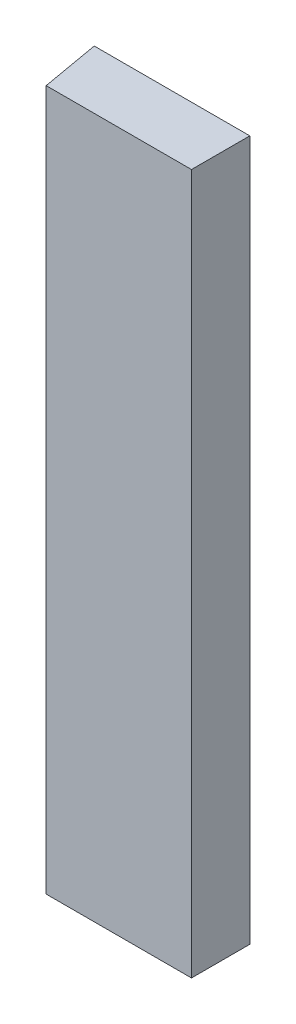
from build123d import *

# Parameters (mm, degrees)
SKETCH1_W           = 101.6
SKETCH1_H           = 38.1
BOSS_EXTRUDE1_DEPTH = 457.2
CUT_EXTRUDE1_DEPTH  = 467.422163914


with BuildPart() as part:
    # Sketch1 → Boss-Extrude1 (new body)
    with BuildSketch(Plane(origin=(0, 0, 0), x_dir=(1, 0, 0), z_dir=(0, 1, 0))):
        with Locations((33.260603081, -19.05)):
            Rectangle(SKETCH1_W, SKETCH1_H)
    extrude(amount=BOSS_EXTRUDE1_DEPTH)

    # Sketch2 → Cut-Extrude1 (cut, through all)
    with BuildSketch(Plane(origin=(0, 457.2, 0), x_dir=(1, 0, 0), z_dir=(0, 1, 0))):
        Polygon((-17.539396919, 0), (-10.821338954, -38.1), (-17.539396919, -38.1), align=None)
    extrude(amount=-CUT_EXTRUDE1_DEPTH, mode=Mode.SUBTRACT)


solid = part.part
